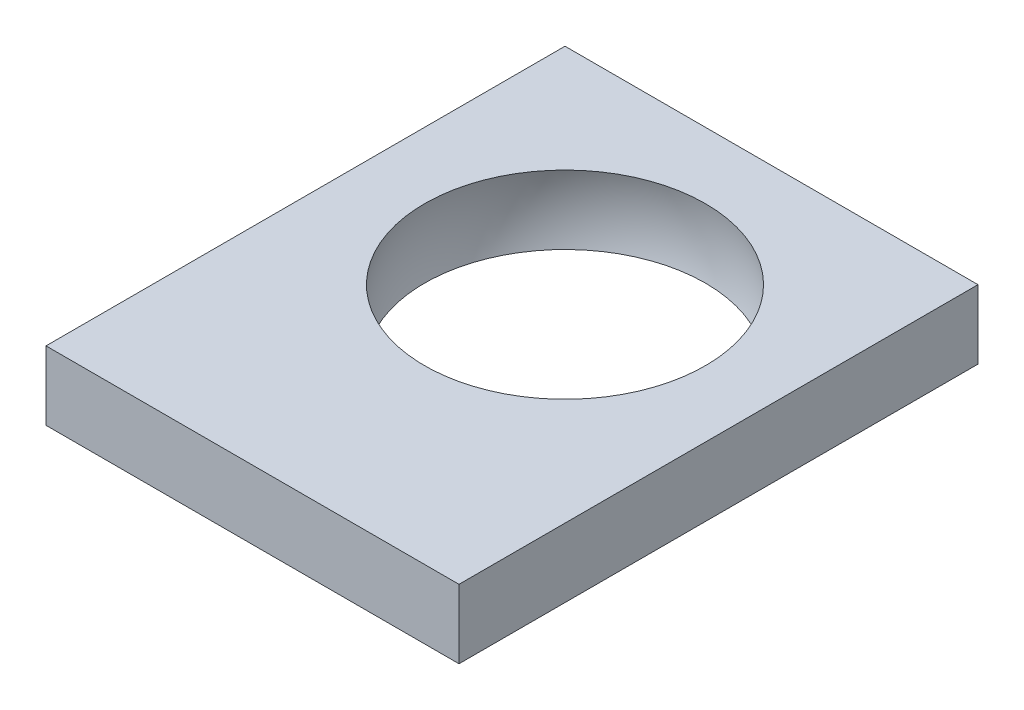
ISO-10303-21;
HEADER;
FILE_DESCRIPTION(('STEP AP214'),'2;1');
FILE_NAME('part.step','',(''),(''),'','','');
FILE_SCHEMA(('AUTOMOTIVE_DESIGN { 1 0 10303 214 1 1 1 1 }'));
ENDSEC;
DATA;
#1=APPLICATION_CONTEXT('core data for automotive mechanical design processes');
#2=APPLICATION_PROTOCOL_DEFINITION('international standard','automotive_design',2000,#1);
#3=PRODUCT_CONTEXT('',#1,'mechanical');
#4=PRODUCT('Part','Part','',(#3));
#5=PRODUCT_RELATED_PRODUCT_CATEGORY('part','',(#4));
#6=PRODUCT_DEFINITION_FORMATION('','',#4);
#7=PRODUCT_DEFINITION_CONTEXT('part definition',#1,'design');
#8=PRODUCT_DEFINITION('design','',#6,#7);
#9=PRODUCT_DEFINITION_SHAPE('','',#8);
#10=(LENGTH_UNIT() NAMED_UNIT(*) SI_UNIT(.MILLI.,.METRE.));
#11=(NAMED_UNIT(*) PLANE_ANGLE_UNIT() SI_UNIT($,.RADIAN.));
#12=(NAMED_UNIT(*) SI_UNIT($,.STERADIAN.) SOLID_ANGLE_UNIT());
#13=UNCERTAINTY_MEASURE_WITH_UNIT(LENGTH_MEASURE(1.E-05),#10,'distance_accuracy_value','');
#14=(GEOMETRIC_REPRESENTATION_CONTEXT(3) GLOBAL_UNCERTAINTY_ASSIGNED_CONTEXT((#13)) GLOBAL_UNIT_ASSIGNED_CONTEXT((#10,
#11,#12)) REPRESENTATION_CONTEXT('',''));
#15=CARTESIAN_POINT('',(0.,0.,0.));
#16=DIRECTION('',(0.,0.,1.));
#17=DIRECTION('',(1.,0.,0.));
#18=AXIS2_PLACEMENT_3D('',#15,#16,#17);
#19=CARTESIAN_POINT('',(0.,0.,70.));
#20=DIRECTION('',(0.,1.,0.));
#21=DIRECTION('',(0.,0.,1.));
#22=AXIS2_PLACEMENT_3D('',#19,#20,#21);
#23=PLANE('',#22);
#24=DIRECTION('',(1.,0.,0.));
#25=VECTOR('',#24,1.);
#26=CARTESIAN_POINT('',(0.,0.,0.));
#27=LINE('',#26,#25);
#28=CARTESIAN_POINT('',(0.,0.,0.));
#29=VERTEX_POINT('',#28);
#30=CARTESIAN_POINT('',(60.,0.,0.));
#31=VERTEX_POINT('',#30);
#32=EDGE_CURVE('E102',#29,#31,#27,.T.);
#33=ORIENTED_EDGE('',*,*,#32,.T.);
#34=DIRECTION('',(0.,0.,-1.));
#35=VECTOR('',#34,1.);
#36=CARTESIAN_POINT('',(60.,0.,70.));
#37=LINE('',#36,#35);
#38=CARTESIAN_POINT('',(60.,0.,75.4012298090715));
#39=VERTEX_POINT('',#38);
#40=EDGE_CURVE('E42',#39,#31,#37,.T.);
#41=ORIENTED_EDGE('',*,*,#40,.F.);
#42=DIRECTION('',(-1.,0.,0.));
#43=VECTOR('',#42,1.);
#44=CARTESIAN_POINT('',(60.,0.,75.4012298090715));
#45=LINE('',#44,#43);
#46=CARTESIAN_POINT('',(0.,0.,75.4012298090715));
#47=VERTEX_POINT('',#46);
#48=EDGE_CURVE('E87',#39,#47,#45,.T.);
#49=ORIENTED_EDGE('',*,*,#48,.T.);
#50=DIRECTION('',(0.,0.,-1.));
#51=VECTOR('',#50,1.);
#52=CARTESIAN_POINT('',(0.,0.,70.));
#53=LINE('',#52,#51);
#54=EDGE_CURVE('E11',#47,#29,#53,.T.);
#55=ORIENTED_EDGE('',*,*,#54,.T.);
#56=EDGE_LOOP('',(#33,#41,#49,#55));
#57=FACE_BOUND('',#56,.T.);
#58=CARTESIAN_POINT('',(30.,0.,30.));
#59=DIRECTION('',(0.,1.,0.));
#60=DIRECTION('',(0.,0.,1.));
#61=AXIS2_PLACEMENT_3D('',#58,#59,#60);
#62=CIRCLE('',#61,20.3960780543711);
#63=CARTESIAN_POINT('',(30.,0.,50.3960780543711));
#64=VERTEX_POINT('',#63);
#65=EDGE_CURVE('E98',#64,#64,#62,.F.);
#66=ORIENTED_EDGE('',*,*,#65,.F.);
#67=EDGE_LOOP('',(#66));
#68=FACE_BOUND('',#67,.T.);
#69=ADVANCED_FACE('F33',(#57,#68),#23,.F.);
#70=CARTESIAN_POINT('',(0.,10.,70.));
#71=DIRECTION('',(0.,-1.,0.));
#72=DIRECTION('',(0.,0.,-1.));
#73=AXIS2_PLACEMENT_3D('',#70,#71,#72);
#74=PLANE('',#73);
#75=DIRECTION('',(-1.,0.,0.));
#76=VECTOR('',#75,1.);
#77=CARTESIAN_POINT('',(0.,10.,0.));
#78=LINE('',#77,#76);
#79=CARTESIAN_POINT('',(60.,10.,0.));
#80=VERTEX_POINT('',#79);
#81=CARTESIAN_POINT('',(0.,10.,0.));
#82=VERTEX_POINT('',#81);
#83=EDGE_CURVE('E49',#80,#82,#78,.T.);
#84=ORIENTED_EDGE('',*,*,#83,.T.);
#85=DIRECTION('',(0.,0.,-1.));
#86=VECTOR('',#85,1.);
#87=CARTESIAN_POINT('',(0.,10.,70.));
#88=LINE('',#87,#86);
#89=CARTESIAN_POINT('',(0.,10.,75.4012298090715));
#90=VERTEX_POINT('',#89);
#91=EDGE_CURVE('E106',#90,#82,#88,.T.);
#92=ORIENTED_EDGE('',*,*,#91,.F.);
#93=DIRECTION('',(1.,0.,0.));
#94=VECTOR('',#93,1.);
#95=CARTESIAN_POINT('',(60.,10.,75.4012298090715));
#96=LINE('',#95,#94);
#97=CARTESIAN_POINT('',(60.,10.,75.4012298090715));
#98=VERTEX_POINT('',#97);
#99=EDGE_CURVE('E90',#90,#98,#96,.T.);
#100=ORIENTED_EDGE('',*,*,#99,.T.);
#101=DIRECTION('',(0.,0.,-1.));
#102=VECTOR('',#101,1.);
#103=CARTESIAN_POINT('',(60.,10.,70.));
#104=LINE('',#103,#102);
#105=EDGE_CURVE('E108',#98,#80,#104,.T.);
#106=ORIENTED_EDGE('',*,*,#105,.T.);
#107=EDGE_LOOP('',(#84,#92,#100,#106));
#108=FACE_BOUND('',#107,.T.);
#109=CARTESIAN_POINT('',(30.,10.,30.));
#110=DIRECTION('',(0.,-1.,0.));
#111=DIRECTION('',(0.,0.,-1.));
#112=AXIS2_PLACEMENT_3D('',#109,#110,#111);
#113=CIRCLE('',#112,20.3960780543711);
#114=CARTESIAN_POINT('',(30.,10.,9.60392194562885));
#115=VERTEX_POINT('',#114);
#116=EDGE_CURVE('E37',#115,#115,#113,.F.);
#117=ORIENTED_EDGE('',*,*,#116,.F.);
#118=EDGE_LOOP('',(#117));
#119=FACE_BOUND('',#118,.T.);
#120=ADVANCED_FACE('F125',(#108,#119),#74,.F.);
#121=CARTESIAN_POINT('',(0.,0.,70.));
#122=DIRECTION('',(1.,0.,0.));
#123=DIRECTION('',(0.,0.,-1.));
#124=AXIS2_PLACEMENT_3D('',#121,#122,#123);
#125=PLANE('',#124);
#126=DIRECTION('',(0.,-1.,0.));
#127=VECTOR('',#126,1.);
#128=CARTESIAN_POINT('',(0.,0.,0.));
#129=LINE('',#128,#127);
#130=EDGE_CURVE('E79',#82,#29,#129,.T.);
#131=ORIENTED_EDGE('',*,*,#130,.T.);
#132=ORIENTED_EDGE('',*,*,#54,.F.);
#133=DIRECTION('',(0.,1.,0.));
#134=VECTOR('',#133,1.);
#135=CARTESIAN_POINT('',(0.,0.,75.4012298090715));
#136=LINE('',#135,#134);
#137=EDGE_CURVE('E77',#47,#90,#136,.T.);
#138=ORIENTED_EDGE('',*,*,#137,.T.);
#139=ORIENTED_EDGE('',*,*,#91,.T.);
#140=EDGE_LOOP('',(#131,#132,#138,#139));
#141=FACE_BOUND('',#140,.T.);
#142=ADVANCED_FACE('F35',(#141),#125,.F.);
#143=CARTESIAN_POINT('',(60.,0.,70.));
#144=DIRECTION('',(-1.,0.,0.));
#145=DIRECTION('',(0.,0.,1.));
#146=AXIS2_PLACEMENT_3D('',#143,#144,#145);
#147=PLANE('',#146);
#148=DIRECTION('',(0.,1.,0.));
#149=VECTOR('',#148,1.);
#150=CARTESIAN_POINT('',(60.,0.,0.));
#151=LINE('',#150,#149);
#152=EDGE_CURVE('E57',#31,#80,#151,.T.);
#153=ORIENTED_EDGE('',*,*,#152,.T.);
#154=ORIENTED_EDGE('',*,*,#105,.F.);
#155=DIRECTION('',(0.,-1.,0.));
#156=VECTOR('',#155,1.);
#157=CARTESIAN_POINT('',(60.,0.,75.4012298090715));
#158=LINE('',#157,#156);
#159=EDGE_CURVE('E96',#98,#39,#158,.T.);
#160=ORIENTED_EDGE('',*,*,#159,.T.);
#161=ORIENTED_EDGE('',*,*,#40,.T.);
#162=EDGE_LOOP('',(#153,#154,#160,#161));
#163=FACE_BOUND('',#162,.T.);
#164=ADVANCED_FACE('F110',(#163),#147,.F.);
#165=CARTESIAN_POINT('',(0.,0.,0.));
#166=DIRECTION('',(0.,0.,-1.));
#167=DIRECTION('',(-1.,0.,0.));
#168=AXIS2_PLACEMENT_3D('',#165,#166,#167);
#169=PLANE('',#168);
#170=ORIENTED_EDGE('',*,*,#130,.F.);
#171=ORIENTED_EDGE('',*,*,#83,.F.);
#172=ORIENTED_EDGE('',*,*,#152,.F.);
#173=ORIENTED_EDGE('',*,*,#32,.F.);
#174=EDGE_LOOP('',(#170,#171,#172,#173));
#175=FACE_BOUND('',#174,.T.);
#176=ADVANCED_FACE('F112',(#175),#169,.T.);
#177=CARTESIAN_POINT('',(30.,5.,30.));
#178=DIRECTION('',(-1.,0.,0.));
#179=DIRECTION('',(0.,0.,-1.));
#180=AXIS2_PLACEMENT_3D('',#177,#178,#179);
#181=SPHERICAL_SURFACE('',#180,21.);
#182=CARTESIAN_POINT('',(30.,5.,30.));
#183=DIRECTION('',(0.,-1.,0.));
#184=DIRECTION('',(0.,0.,-1.));
#185=AXIS2_PLACEMENT_3D('',#182,#183,#184);
#186=SPHERICAL_SURFACE('',#185,21.);
#187=ORIENTED_EDGE('',*,*,#116,.T.);
#188=EDGE_LOOP('',(#187));
#189=FACE_BOUND('',#188,.T.);
#190=ORIENTED_EDGE('',*,*,#65,.T.);
#191=EDGE_LOOP('',(#190));
#192=FACE_BOUND('',#191,.T.);
#193=ADVANCED_FACE('F114',(#189,#192),#186,.F.);
#194=CARTESIAN_POINT('',(84.6895586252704,-159.143775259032,75.4012298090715));
#195=DIRECTION('',(0.,0.,-1.));
#196=DIRECTION('',(0.,1.,0.));
#197=AXIS2_PLACEMENT_3D('',#194,#195,#196);
#198=PLANE('',#197);
#199=ORIENTED_EDGE('',*,*,#99,.F.);
#200=ORIENTED_EDGE('',*,*,#137,.F.);
#201=ORIENTED_EDGE('',*,*,#48,.F.);
#202=ORIENTED_EDGE('',*,*,#159,.F.);
#203=EDGE_LOOP('',(#199,#200,#201,#202));
#204=FACE_BOUND('',#203,.T.);
#205=ADVANCED_FACE('F85',(#204),#198,.F.);
#206=CLOSED_SHELL('',(#69,#120,#142,#164,#176,#193,#205));
#207=MANIFOLD_SOLID_BREP('B2',#206);
#208=ADVANCED_BREP_SHAPE_REPRESENTATION('',(#18,#207),#14);
#209=SHAPE_DEFINITION_REPRESENTATION(#9,#208);
ENDSEC;
END-ISO-10303-21;
